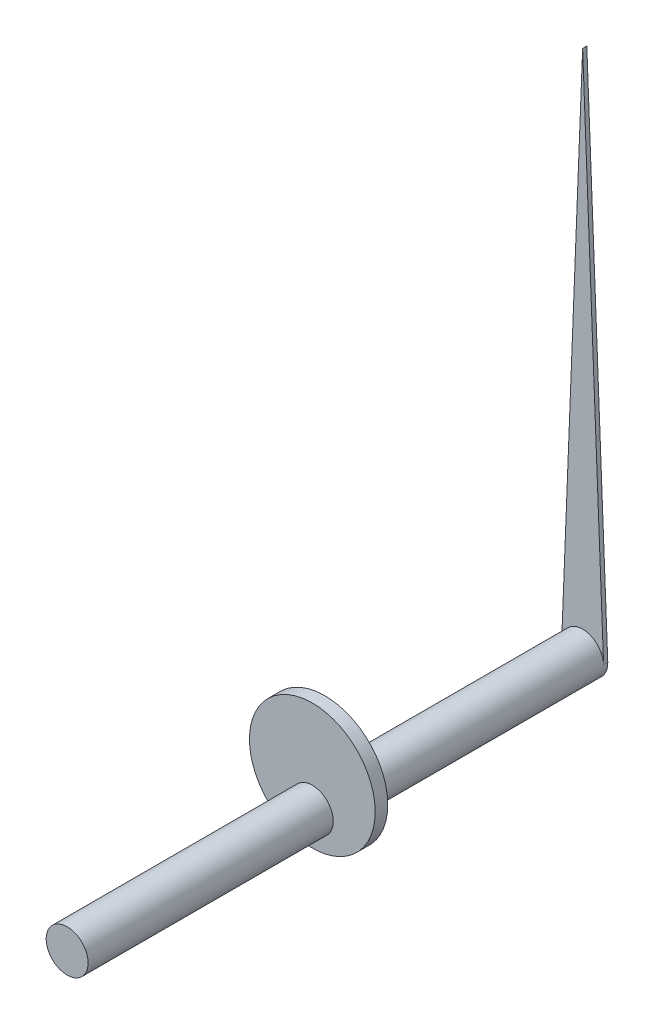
ISO-10303-21;
HEADER;
FILE_DESCRIPTION(('STEP AP214'),'2;1');
FILE_NAME('part.step','',(''),(''),'','','');
FILE_SCHEMA(('AUTOMOTIVE_DESIGN { 1 0 10303 214 1 1 1 1 }'));
ENDSEC;
DATA;
#1=APPLICATION_CONTEXT('core data for automotive mechanical design processes');
#2=APPLICATION_PROTOCOL_DEFINITION('international standard','automotive_design',2000,#1);
#3=PRODUCT_CONTEXT('',#1,'mechanical');
#4=PRODUCT('Part','Part','',(#3));
#5=PRODUCT_RELATED_PRODUCT_CATEGORY('part','',(#4));
#6=PRODUCT_DEFINITION_FORMATION('','',#4);
#7=PRODUCT_DEFINITION_CONTEXT('part definition',#1,'design');
#8=PRODUCT_DEFINITION('design','',#6,#7);
#9=PRODUCT_DEFINITION_SHAPE('','',#8);
#10=(LENGTH_UNIT() NAMED_UNIT(*) SI_UNIT(.MILLI.,.METRE.));
#11=(NAMED_UNIT(*) PLANE_ANGLE_UNIT() SI_UNIT($,.RADIAN.));
#12=(NAMED_UNIT(*) SI_UNIT($,.STERADIAN.) SOLID_ANGLE_UNIT());
#13=UNCERTAINTY_MEASURE_WITH_UNIT(LENGTH_MEASURE(1.E-05),#10,'distance_accuracy_value','');
#14=(GEOMETRIC_REPRESENTATION_CONTEXT(3) GLOBAL_UNCERTAINTY_ASSIGNED_CONTEXT((#13)) GLOBAL_UNIT_ASSIGNED_CONTEXT((#10,
#11,#12)) REPRESENTATION_CONTEXT('',''));
#15=CARTESIAN_POINT('',(0.,0.,0.));
#16=DIRECTION('',(0.,0.,1.));
#17=DIRECTION('',(1.,0.,0.));
#18=AXIS2_PLACEMENT_3D('',#15,#16,#17);
#19=CARTESIAN_POINT('',(0.,0.,61.5));
#20=DIRECTION('',(0.,0.,-1.));
#21=DIRECTION('',(-1.,0.,0.));
#22=AXIS2_PLACEMENT_3D('',#19,#20,#21);
#23=CYLINDRICAL_SURFACE('',#22,5.);
#24=CARTESIAN_POINT('',(0.,0.,3.));
#25=DIRECTION('',(0.,0.,1.));
#26=DIRECTION('',(1.,0.,0.));
#27=AXIS2_PLACEMENT_3D('',#24,#25,#26);
#28=CIRCLE('',#27,5.);
#29=CARTESIAN_POINT('',(5.,0.,3.));
#30=VERTEX_POINT('',#29);
#31=EDGE_CURVE('E83',#30,#30,#28,.T.);
#32=ORIENTED_EDGE('',*,*,#31,.T.);
#33=EDGE_LOOP('',(#32));
#34=FACE_BOUND('',#33,.T.);
#35=CARTESIAN_POINT('',(0.,0.,61.5));
#36=DIRECTION('',(0.,0.,1.));
#37=DIRECTION('',(1.,0.,0.));
#38=AXIS2_PLACEMENT_3D('',#35,#36,#37);
#39=CIRCLE('',#38,5.);
#40=CARTESIAN_POINT('',(5.,0.,61.5));
#41=VERTEX_POINT('',#40);
#42=EDGE_CURVE('E36',#41,#41,#39,.T.);
#43=ORIENTED_EDGE('',*,*,#42,.F.);
#44=EDGE_LOOP('',(#43));
#45=FACE_BOUND('',#44,.T.);
#46=ADVANCED_FACE('F28',(#34,#45),#23,.T.);
#47=CARTESIAN_POINT('',(0.,0.,61.5));
#48=DIRECTION('',(0.,0.,1.));
#49=DIRECTION('',(1.,0.,0.));
#50=AXIS2_PLACEMENT_3D('',#47,#48,#49);
#51=PLANE('',#50);
#52=ORIENTED_EDGE('',*,*,#42,.T.);
#53=EDGE_LOOP('',(#52));
#54=FACE_BOUND('',#53,.T.);
#55=ADVANCED_FACE('F133',(#54),#51,.T.);
#56=CARTESIAN_POINT('',(0.,7.,3.));
#57=DIRECTION('',(0.,0.,1.));
#58=DIRECTION('',(1.,0.,0.));
#59=AXIS2_PLACEMENT_3D('',#56,#57,#58);
#60=PLANE('',#59);
#61=CARTESIAN_POINT('',(0.,7.,3.));
#62=DIRECTION('',(0.,0.,1.));
#63=DIRECTION('',(1.,0.,0.));
#64=AXIS2_PLACEMENT_3D('',#61,#62,#63);
#65=CIRCLE('',#64,15.);
#66=CARTESIAN_POINT('',(15.,7.,3.));
#67=VERTEX_POINT('',#66);
#68=EDGE_CURVE('E88',#67,#67,#65,.T.);
#69=ORIENTED_EDGE('',*,*,#68,.T.);
#70=EDGE_LOOP('',(#69));
#71=FACE_BOUND('',#70,.T.);
#72=ORIENTED_EDGE('',*,*,#31,.F.);
#73=EDGE_LOOP('',(#72));
#74=FACE_BOUND('',#73,.T.);
#75=ADVANCED_FACE('F112',(#71,#74),#60,.T.);
#76=CARTESIAN_POINT('',(0.,7.,0.));
#77=DIRECTION('',(0.,0.,1.));
#78=DIRECTION('',(1.,0.,0.));
#79=AXIS2_PLACEMENT_3D('',#76,#77,#78);
#80=PLANE('',#79);
#81=CARTESIAN_POINT('',(0.,7.,0.));
#82=DIRECTION('',(0.,0.,1.));
#83=DIRECTION('',(1.,0.,0.));
#84=AXIS2_PLACEMENT_3D('',#81,#82,#83);
#85=CIRCLE('',#84,15.);
#86=CARTESIAN_POINT('',(15.,7.,0.));
#87=VERTEX_POINT('',#86);
#88=EDGE_CURVE('E79',#87,#87,#85,.T.);
#89=ORIENTED_EDGE('',*,*,#88,.F.);
#90=EDGE_LOOP('',(#89));
#91=FACE_BOUND('',#90,.T.);
#92=CARTESIAN_POINT('',(0.,0.,0.));
#93=DIRECTION('',(0.,0.,1.));
#94=DIRECTION('',(1.,0.,0.));
#95=AXIS2_PLACEMENT_3D('',#92,#93,#94);
#96=CIRCLE('',#95,5.);
#97=CARTESIAN_POINT('',(5.,0.,0.));
#98=VERTEX_POINT('',#97);
#99=EDGE_CURVE('E11',#98,#98,#96,.T.);
#100=ORIENTED_EDGE('',*,*,#99,.T.);
#101=EDGE_LOOP('',(#100));
#102=FACE_BOUND('',#101,.T.);
#103=ADVANCED_FACE('F118',(#91,#102),#80,.F.);
#104=CARTESIAN_POINT('',(0.,7.,3.));
#105=DIRECTION('',(0.,0.,-1.));
#106=DIRECTION('',(-1.,0.,0.));
#107=AXIS2_PLACEMENT_3D('',#104,#105,#106);
#108=CYLINDRICAL_SURFACE('',#107,15.);
#109=ORIENTED_EDGE('',*,*,#68,.F.);
#110=EDGE_LOOP('',(#109));
#111=FACE_BOUND('',#110,.T.);
#112=ORIENTED_EDGE('',*,*,#88,.T.);
#113=EDGE_LOOP('',(#112));
#114=FACE_BOUND('',#113,.T.);
#115=ADVANCED_FACE('F115',(#111,#114),#108,.T.);
#116=CARTESIAN_POINT('',(0.,0.,-61.5));
#117=DIRECTION('',(0.,0.,1.));
#118=DIRECTION('',(1.,0.,0.));
#119=AXIS2_PLACEMENT_3D('',#116,#117,#118);
#120=CIRCLE('',#119,5.);
#121=CARTESIAN_POINT('',(4.99599839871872,0.2,-61.5));
#122=VERTEX_POINT('',#121);
#123=CARTESIAN_POINT('',(-4.99599839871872,0.2,-61.5));
#124=VERTEX_POINT('',#123);
#125=EDGE_CURVE('E69',#122,#124,#120,.T.);
#126=ORIENTED_EDGE('',*,*,#125,.T.);
#127=DIRECTION('',(0.,0.,1.));
#128=VECTOR('',#127,1.);
#129=CARTESIAN_POINT('',(-4.99599839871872,0.2,-62.5));
#130=LINE('',#129,#128);
#131=CARTESIAN_POINT('',(-4.99599839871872,0.2,-62.5));
#132=VERTEX_POINT('',#131);
#133=EDGE_CURVE('E76',#132,#124,#130,.T.);
#134=ORIENTED_EDGE('',*,*,#133,.F.);
#135=CARTESIAN_POINT('',(0.,0.,-62.5));
#136=DIRECTION('',(0.,0.,-1.));
#137=DIRECTION('',(-1.,0.,0.));
#138=AXIS2_PLACEMENT_3D('',#135,#136,#137);
#139=CIRCLE('',#138,5.);
#140=CARTESIAN_POINT('',(4.99599839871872,0.2,-62.5));
#141=VERTEX_POINT('',#140);
#142=EDGE_CURVE('E97',#141,#132,#139,.T.);
#143=ORIENTED_EDGE('',*,*,#142,.F.);
#144=DIRECTION('',(0.,0.,1.));
#145=VECTOR('',#144,1.);
#146=CARTESIAN_POINT('',(4.99599839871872,0.2,-62.5));
#147=LINE('',#146,#145);
#148=EDGE_CURVE('E44',#141,#122,#147,.T.);
#149=ORIENTED_EDGE('',*,*,#148,.T.);
#150=EDGE_LOOP('',(#126,#134,#143,#149));
#151=FACE_BOUND('',#150,.T.);
#152=ORIENTED_EDGE('',*,*,#99,.F.);
#153=EDGE_LOOP('',(#152));
#154=FACE_BOUND('',#153,.T.);
#155=ADVANCED_FACE('F81',(#151,#154),#23,.T.);
#156=CARTESIAN_POINT('',(-4.99599839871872,0.2,-62.5));
#157=DIRECTION('',(0.999199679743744,-0.04,0.));
#158=DIRECTION('',(0.04,0.999199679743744,0.));
#159=AXIS2_PLACEMENT_3D('',#156,#157,#158);
#160=PLANE('',#159);
#161=DIRECTION('',(0.04,0.999199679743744,0.));
#162=VECTOR('',#161,1.);
#163=CARTESIAN_POINT('',(-4.99599839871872,0.2,-61.5));
#164=LINE('',#163,#162);
#165=CARTESIAN_POINT('',(0.,125.,-61.5));
#166=VERTEX_POINT('',#165);
#167=EDGE_CURVE('E66',#124,#166,#164,.T.);
#168=ORIENTED_EDGE('',*,*,#167,.T.);
#169=DIRECTION('',(0.,0.,1.));
#170=VECTOR('',#169,1.);
#171=CARTESIAN_POINT('',(0.,125.,-62.5));
#172=LINE('',#171,#170);
#173=CARTESIAN_POINT('',(0.,125.,-62.5));
#174=VERTEX_POINT('',#173);
#175=EDGE_CURVE('E80',#174,#166,#172,.T.);
#176=ORIENTED_EDGE('',*,*,#175,.F.);
#177=DIRECTION('',(0.04,0.999199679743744,0.));
#178=VECTOR('',#177,1.);
#179=CARTESIAN_POINT('',(-4.99599839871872,0.2,-62.5));
#180=LINE('',#179,#178);
#181=EDGE_CURVE('E78',#132,#174,#180,.T.);
#182=ORIENTED_EDGE('',*,*,#181,.F.);
#183=ORIENTED_EDGE('',*,*,#133,.T.);
#184=EDGE_LOOP('',(#168,#176,#182,#183));
#185=FACE_BOUND('',#184,.T.);
#186=ADVANCED_FACE('F77',(#185),#160,.F.);
#187=CARTESIAN_POINT('',(4.99599839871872,0.2,-62.5));
#188=DIRECTION('',(-0.999199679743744,-0.04,0.));
#189=DIRECTION('',(0.04,-0.999199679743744,0.));
#190=AXIS2_PLACEMENT_3D('',#187,#188,#189);
#191=PLANE('',#190);
#192=DIRECTION('',(0.04,-0.999199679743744,0.));
#193=VECTOR('',#192,1.);
#194=CARTESIAN_POINT('',(4.99599839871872,0.2,-61.5));
#195=LINE('',#194,#193);
#196=EDGE_CURVE('E70',#166,#122,#195,.T.);
#197=ORIENTED_EDGE('',*,*,#196,.T.);
#198=ORIENTED_EDGE('',*,*,#148,.F.);
#199=DIRECTION('',(0.04,-0.999199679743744,0.));
#200=VECTOR('',#199,1.);
#201=CARTESIAN_POINT('',(4.99599839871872,0.2,-62.5));
#202=LINE('',#201,#200);
#203=EDGE_CURVE('E52',#174,#141,#202,.T.);
#204=ORIENTED_EDGE('',*,*,#203,.F.);
#205=ORIENTED_EDGE('',*,*,#175,.T.);
#206=EDGE_LOOP('',(#197,#198,#204,#205));
#207=FACE_BOUND('',#206,.T.);
#208=ADVANCED_FACE('F130',(#207),#191,.F.);
#209=CARTESIAN_POINT('',(0.,0.,-62.5));
#210=DIRECTION('',(0.,0.,-1.));
#211=DIRECTION('',(-1.,0.,0.));
#212=AXIS2_PLACEMENT_3D('',#209,#210,#211);
#213=PLANE('',#212);
#214=ORIENTED_EDGE('',*,*,#142,.T.);
#215=ORIENTED_EDGE('',*,*,#181,.T.);
#216=ORIENTED_EDGE('',*,*,#203,.T.);
#217=EDGE_LOOP('',(#214,#215,#216));
#218=FACE_BOUND('',#217,.T.);
#219=ADVANCED_FACE('F149',(#218),#213,.T.);
#220=CARTESIAN_POINT('',(0.,0.,-61.5));
#221=DIRECTION('',(0.,0.,-1.));
#222=DIRECTION('',(-1.,0.,0.));
#223=AXIS2_PLACEMENT_3D('',#220,#221,#222);
#224=PLANE('',#223);
#225=ORIENTED_EDGE('',*,*,#125,.F.);
#226=ORIENTED_EDGE('',*,*,#196,.F.);
#227=ORIENTED_EDGE('',*,*,#167,.F.);
#228=EDGE_LOOP('',(#225,#226,#227));
#229=FACE_BOUND('',#228,.T.);
#230=ADVANCED_FACE('F68',(#229),#224,.F.);
#231=CLOSED_SHELL('',(#46,#55,#75,#103,#115,#155,#186,#208,#219,#230));
#232=MANIFOLD_SOLID_BREP('B2',#231);
#233=ADVANCED_BREP_SHAPE_REPRESENTATION('',(#18,#232),#14);
#234=SHAPE_DEFINITION_REPRESENTATION(#9,#233);
ENDSEC;
END-ISO-10303-21;
